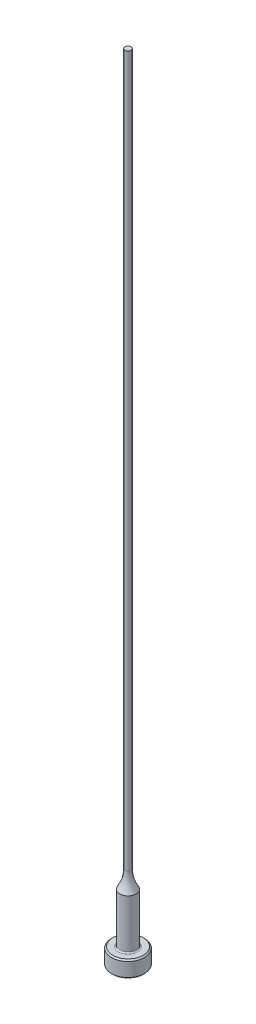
from build123d import *

# Parameters (mm, degrees)
CHAMFER1_SIZE = 0.254
FILLET1_R     = 0.254


with BuildPart() as part:
    # Sketch1 → Revolve1 (revolve)
    with BuildSketch(Plane.XY, mode=Mode.PRIVATE) as revolve1_sk:
        with BuildLine():
            Line((0, 0), (-3.175, 0))
            Line((-3.175, 0), (-3.175, 3.175))
            Line((-3.175, 3.175), (-1.5875, 3.175))
            Line((-1.5875, 3.175), (-1.5875, 12.7))
            ThreePointArc((-1.5875, 12.7), (-0.847698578, 14.334042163), (-0.59436, 16.109772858))
            Line((-0.59436, 16.109772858), (-0.59436, 152.4))
            Line((-0.59436, 152.4), (0, 152.4))
            Line((0, 152.4), (0, 0))
        make_face()
    revolve(revolve1_sk.sketch.rotate(Axis((0, 259.958771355, 0), (0, -1, 0)), 270), axis=Axis((0, 259.958771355, 0), (0, -1, 0)))

    # Chamfer1
    chamfer1_edges = [part.edges().sort_by_distance(p)[0] for p in [
        (0, 0, -3.175),
        (0, 3.175, -3.175),
    ]]
    chamfer(chamfer1_edges, length=CHAMFER1_SIZE)

    # Fillet1
    fillet1_edges = [part.edges().sort_by_distance(p)[0] for p in [
        (0, 3.175, -1.5875),
    ]]
    fillet(fillet1_edges, radius=FILLET1_R)


solid = part.part
